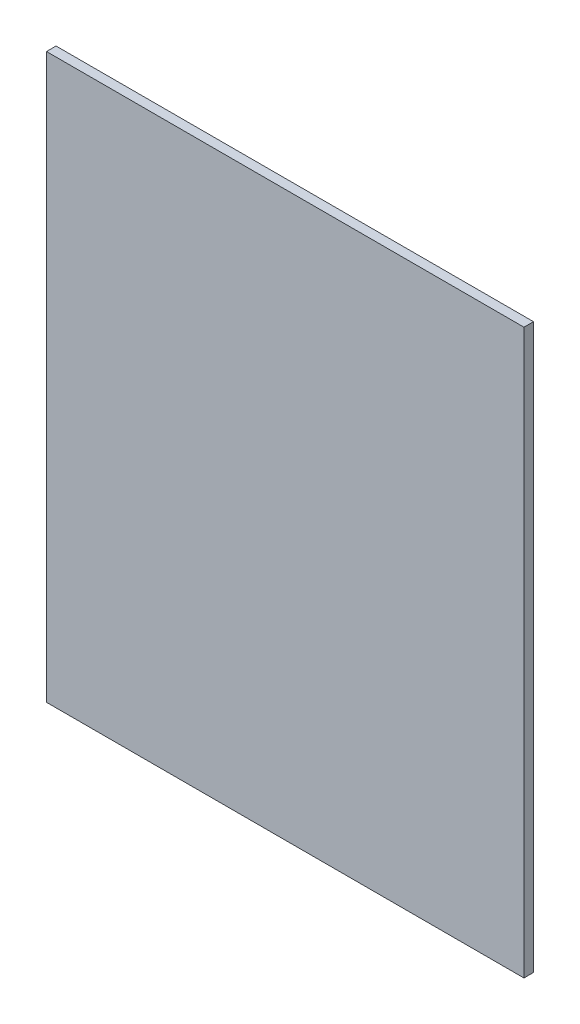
from build123d import *

# Parameters (mm, degrees)
CROQUIS1_W              = 10
CROQUIS1_H              = 590.213783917
SALIENTE_EXTRUIR1_DEPTH = 500


with BuildPart() as part:
    # Croquis1 → Saliente-Extruir1 (new body)
    with BuildSketch(Plane.ZY.offset(-510)):
        with Locations((-5, 295.106891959)):
            Rectangle(CROQUIS1_W, CROQUIS1_H)
    extrude(amount=SALIENTE_EXTRUIR1_DEPTH)


solid = part.part
